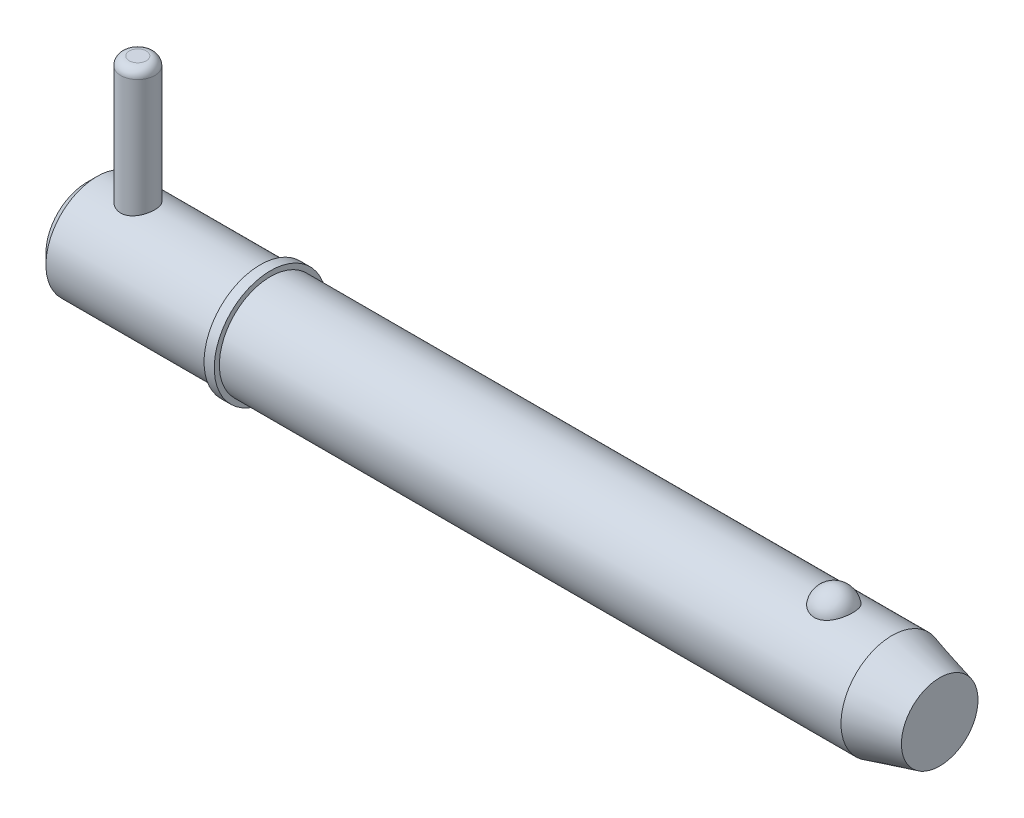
ISO-10303-21;
HEADER;
FILE_DESCRIPTION(('STEP AP214'),'2;1');
FILE_NAME('part.step','',(''),(''),'','','');
FILE_SCHEMA(('AUTOMOTIVE_DESIGN { 1 0 10303 214 1 1 1 1 }'));
ENDSEC;
DATA;
#1=APPLICATION_CONTEXT('core data for automotive mechanical design processes');
#2=APPLICATION_PROTOCOL_DEFINITION('international standard','automotive_design',2000,#1);
#3=PRODUCT_CONTEXT('',#1,'mechanical');
#4=PRODUCT('Part','Part','',(#3));
#5=PRODUCT_RELATED_PRODUCT_CATEGORY('part','',(#4));
#6=PRODUCT_DEFINITION_FORMATION('','',#4);
#7=PRODUCT_DEFINITION_CONTEXT('part definition',#1,'design');
#8=PRODUCT_DEFINITION('design','',#6,#7);
#9=PRODUCT_DEFINITION_SHAPE('','',#8);
#10=(LENGTH_UNIT() NAMED_UNIT(*) SI_UNIT(.MILLI.,.METRE.));
#11=(NAMED_UNIT(*) PLANE_ANGLE_UNIT() SI_UNIT($,.RADIAN.));
#12=(NAMED_UNIT(*) SI_UNIT($,.STERADIAN.) SOLID_ANGLE_UNIT());
#13=UNCERTAINTY_MEASURE_WITH_UNIT(LENGTH_MEASURE(1.E-05),#10,'distance_accuracy_value','');
#14=(GEOMETRIC_REPRESENTATION_CONTEXT(3) GLOBAL_UNCERTAINTY_ASSIGNED_CONTEXT((#13)) GLOBAL_UNIT_ASSIGNED_CONTEXT((#10,
#11,#12)) REPRESENTATION_CONTEXT('',''));
#15=CARTESIAN_POINT('',(0.,0.,0.));
#16=DIRECTION('',(0.,0.,1.));
#17=DIRECTION('',(1.,0.,0.));
#18=AXIS2_PLACEMENT_3D('',#15,#16,#17);
#19=CARTESIAN_POINT('',(7.14,24.605,0.));
#20=DIRECTION('',(0.,-1.,0.));
#21=DIRECTION('',(0.,0.,-1.));
#22=AXIS2_PLACEMENT_3D('',#19,#20,#21);
#23=CYLINDRICAL_SURFACE('',#22,2.38);
#24=CARTESIAN_POINT('',(7.14,-5.955,0.));
#25=DIRECTION('',(0.,1.,0.));
#26=DIRECTION('',(0.,0.,1.));
#27=AXIS2_PLACEMENT_3D('',#24,#25,#26);
#28=CIRCLE('',#27,2.38);
#29=CARTESIAN_POINT('',(7.14,-5.955,2.38));
#30=VERTEX_POINT('',#29);
#31=EDGE_CURVE('P0_E25',#30,#30,#28,.T.);
#32=ORIENTED_EDGE('',*,*,#31,.T.);
#33=EDGE_LOOP('',(#32));
#34=FACE_BOUND('',#33,.T.);
#35=CARTESIAN_POINT('',(7.14,23.415,0.));
#36=DIRECTION('',(0.,1.,0.));
#37=DIRECTION('',(0.,0.,1.));
#38=AXIS2_PLACEMENT_3D('',#35,#36,#37);
#39=CIRCLE('',#38,2.38);
#40=CARTESIAN_POINT('',(7.14,23.415,2.38));
#41=VERTEX_POINT('',#40);
#42=EDGE_CURVE('P0_E29',#41,#41,#39,.F.);
#43=ORIENTED_EDGE('',*,*,#42,.T.);
#44=EDGE_LOOP('',(#43));
#45=FACE_BOUND('',#44,.T.);
#46=ADVANCED_FACE('P0_F14',(#34,#45),#23,.T.);
#47=CARTESIAN_POINT('',(7.14,24.605,0.));
#48=DIRECTION('',(0.,1.,0.));
#49=DIRECTION('',(0.,0.,1.));
#50=AXIS2_PLACEMENT_3D('',#47,#48,#49);
#51=PLANE('',#50);
#52=CARTESIAN_POINT('',(7.14,24.605,0.));
#53=DIRECTION('',(0.,1.,0.));
#54=DIRECTION('',(0.,0.,1.));
#55=AXIS2_PLACEMENT_3D('',#52,#53,#54);
#56=CIRCLE('',#55,1.19);
#57=CARTESIAN_POINT('',(7.14,24.605,1.19));
#58=VERTEX_POINT('',#57);
#59=EDGE_CURVE('P0_E10',#58,#58,#56,.T.);
#60=ORIENTED_EDGE('',*,*,#59,.T.);
#61=EDGE_LOOP('',(#60));
#62=FACE_BOUND('',#61,.T.);
#63=ADVANCED_FACE('P0_F46',(#62),#51,.T.);
#64=CARTESIAN_POINT('',(7.14,-7.145,0.));
#65=DIRECTION('',(0.,1.,0.));
#66=DIRECTION('',(0.,0.,1.));
#67=AXIS2_PLACEMENT_3D('',#64,#65,#66);
#68=PLANE('',#67);
#69=CARTESIAN_POINT('',(7.14,-7.145,0.));
#70=DIRECTION('',(0.,1.,0.));
#71=DIRECTION('',(0.,0.,1.));
#72=AXIS2_PLACEMENT_3D('',#69,#70,#71);
#73=CIRCLE('',#72,1.19);
#74=CARTESIAN_POINT('',(7.14,-7.145,1.19));
#75=VERTEX_POINT('',#74);
#76=EDGE_CURVE('P0_E21',#75,#75,#73,.F.);
#77=ORIENTED_EDGE('',*,*,#76,.T.);
#78=EDGE_LOOP('',(#77));
#79=FACE_BOUND('',#78,.T.);
#80=ADVANCED_FACE('P0_F43',(#79),#68,.F.);
#81=CARTESIAN_POINT('',(7.14,-5.955,0.));
#82=DIRECTION('',(0.,1.,0.));
#83=DIRECTION('',(0.,0.,1.));
#84=AXIS2_PLACEMENT_3D('',#81,#82,#83);
#85=DEGENERATE_TOROIDAL_SURFACE('',#84,1.19,1.19,.T.);
#86=ORIENTED_EDGE('',*,*,#76,.F.);
#87=EDGE_LOOP('',(#86));
#88=FACE_BOUND('',#87,.T.);
#89=ORIENTED_EDGE('',*,*,#31,.F.);
#90=EDGE_LOOP('',(#89));
#91=FACE_BOUND('',#90,.T.);
#92=ADVANCED_FACE('P0_F38',(#88,#91),#85,.T.);
#93=CARTESIAN_POINT('',(7.14,23.415,0.));
#94=DIRECTION('',(0.,1.,0.));
#95=DIRECTION('',(0.,0.,1.));
#96=AXIS2_PLACEMENT_3D('',#93,#94,#95);
#97=DEGENERATE_TOROIDAL_SURFACE('',#96,1.19,1.19,.T.);
#98=ORIENTED_EDGE('',*,*,#42,.F.);
#99=EDGE_LOOP('',(#98));
#100=FACE_BOUND('',#99,.T.);
#101=ORIENTED_EDGE('',*,*,#59,.F.);
#102=EDGE_LOOP('',(#101));
#103=FACE_BOUND('',#102,.T.);
#104=ADVANCED_FACE('P0_F16',(#100,#103),#97,.T.);
#105=CLOSED_SHELL('',(#46,#63,#80,#92,#104));
#106=MANIFOLD_SOLID_BREP('P0_B1',#105);
#107=CARTESIAN_POINT('',(0.,0.,0.));
#108=DIRECTION('',(1.,0.,0.));
#109=DIRECTION('',(0.,0.,-1.));
#110=AXIS2_PLACEMENT_3D('',#107,#108,#109);
#111=CYLINDRICAL_SURFACE('',#110,7.145);
#112=CARTESIAN_POINT('',(112.68362424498,0.,0.));
#113=DIRECTION('',(1.,0.,0.));
#114=DIRECTION('',(0.,0.,-1.));
#115=AXIS2_PLACEMENT_3D('',#112,#113,#114);
#116=CIRCLE('',#115,7.145);
#117=CARTESIAN_POINT('',(112.68362424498,0.,-7.145));
#118=VERTEX_POINT('',#117);
#119=EDGE_CURVE('P1_E81',#118,#118,#116,.T.);
#120=ORIENTED_EDGE('',*,*,#119,.F.);
#121=EDGE_LOOP('',(#120));
#122=FACE_BOUND('',#121,.T.);
#123=CARTESIAN_POINT('',(25.7,0.,0.));
#124=DIRECTION('',(1.,0.,0.));
#125=DIRECTION('',(0.,0.,-1.));
#126=AXIS2_PLACEMENT_3D('',#123,#124,#125);
#127=CIRCLE('',#126,7.145);
#128=CARTESIAN_POINT('',(25.7,0.,-7.145));
#129=VERTEX_POINT('',#128);
#130=EDGE_CURVE('P1_E85',#129,#129,#127,.T.);
#131=ORIENTED_EDGE('',*,*,#130,.T.);
#132=EDGE_LOOP('',(#131));
#133=FACE_BOUND('',#132,.T.);
#134=CARTESIAN_POINT('',(104.539503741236,6.60328629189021,2.72903557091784));
#135=CARTESIAN_POINT('',(104.398315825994,6.60329644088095,2.7290249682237));
#136=CARTESIAN_POINT('',(104.256883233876,6.60799490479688,2.71772840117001));
#137=CARTESIAN_POINT('',(103.977955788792,6.62628236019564,2.67281935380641));
#138=CARTESIAN_POINT('',(103.840472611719,6.63989534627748,2.63914664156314));
#139=CARTESIAN_POINT('',(103.573889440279,6.67440775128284,2.55059642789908));
#140=CARTESIAN_POINT('',(103.444768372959,6.69528793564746,2.49577486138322));
#141=CARTESIAN_POINT('',(103.197869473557,6.74205585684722,2.36651799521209));
#142=CARTESIAN_POINT('',(103.080086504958,6.76794130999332,2.29209163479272));
#143=CARTESIAN_POINT('',(102.85516710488,6.82286177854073,2.12312937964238));
#144=CARTESIAN_POINT('',(102.748440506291,6.85196655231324,2.02807107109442));
#145=CARTESIAN_POINT('',(102.551918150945,6.90970232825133,1.82167822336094));
#146=CARTESIAN_POINT('',(102.462127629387,6.93833318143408,1.71033867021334));
#147=CARTESIAN_POINT('',(102.297667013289,6.9935167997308,1.46891951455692));
#148=CARTESIAN_POINT('',(102.223844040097,7.01992110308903,1.33822781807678));
#149=CARTESIAN_POINT('',(102.098088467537,7.06643385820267,1.06566567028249));
#150=CARTESIAN_POINT('',(102.04615735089,7.08654188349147,0.923794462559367));
#151=CARTESIAN_POINT('',(101.964732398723,7.11862399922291,0.630993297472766));
#152=CARTESIAN_POINT('',(101.935516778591,7.13049704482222,0.479974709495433));
#153=CARTESIAN_POINT('',(101.901174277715,7.14449484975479,0.174782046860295));
#154=CARTESIAN_POINT('',(101.896046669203,7.14661990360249,0.0206080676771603));
#155=CARTESIAN_POINT('',(101.909938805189,7.14092465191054,-0.285506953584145));
#156=CARTESIAN_POINT('',(101.928810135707,7.1331654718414,-0.43745589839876));
#157=CARTESIAN_POINT('',(101.990062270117,7.10859076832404,-0.735778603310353));
#158=CARTESIAN_POINT('',(102.032443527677,7.0917750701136,-0.882152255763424));
#159=CARTESIAN_POINT('',(102.139934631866,7.05076716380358,-1.165431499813));
#160=CARTESIAN_POINT('',(102.205075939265,7.02656475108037,-1.30232366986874));
#161=CARTESIAN_POINT('',(102.356759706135,6.97329145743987,-1.56265907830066));
#162=CARTESIAN_POINT('',(102.443303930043,6.94422017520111,-1.68610120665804));
#163=CARTESIAN_POINT('',(102.636465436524,6.88415108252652,-1.91671004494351));
#164=CARTESIAN_POINT('',(102.743180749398,6.85314438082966,-2.02379244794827));
#165=CARTESIAN_POINT('',(102.973974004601,6.79282069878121,-2.21787433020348));
#166=CARTESIAN_POINT('',(103.098050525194,6.76350358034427,-2.30487545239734));
#167=CARTESIAN_POINT('',(103.357678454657,6.71060580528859,-2.45458647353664));
#168=CARTESIAN_POINT('',(103.492938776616,6.68691885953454,-2.51776240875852));
#169=CARTESIAN_POINT('',(103.773277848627,6.64741247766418,-2.62030218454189));
#170=CARTESIAN_POINT('',(103.918352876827,6.63159007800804,-2.65967499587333));
#171=CARTESIAN_POINT('',(104.206347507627,6.61038594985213,-2.71193301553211));
#172=CARTESIAN_POINT('',(104.34900807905,6.60451880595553,-2.72605165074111));
#173=CARTESIAN_POINT('',(104.634800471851,6.60240611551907,-2.73116688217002));
#174=CARTESIAN_POINT('',(104.777932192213,6.60615862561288,-2.7221681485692));
#175=CARTESIAN_POINT('',(105.055848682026,6.6225609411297,-2.68200435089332));
#176=CARTESIAN_POINT('',(105.190754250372,6.63492533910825,-2.65154998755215));
#177=CARTESIAN_POINT('',(105.45332009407,6.66687445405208,-2.57015684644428));
#178=CARTESIAN_POINT('',(105.58097978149,6.68645975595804,-2.51921640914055));
#179=CARTESIAN_POINT('',(105.828577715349,6.73127274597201,-2.39693610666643));
#180=CARTESIAN_POINT('',(105.948287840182,6.7566138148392,-2.32517694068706));
#181=CARTESIAN_POINT('',(106.174159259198,6.81006003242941,-2.16363812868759));
#182=CARTESIAN_POINT('',(106.280317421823,6.83816581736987,-2.07385432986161));
#183=CARTESIAN_POINT('',(106.481862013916,6.89580469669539,-1.87357235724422));
#184=CARTESIAN_POINT('',(106.576440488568,6.92533863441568,-1.76226074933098));
#185=CARTESIAN_POINT('',(106.746332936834,6.98139526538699,-1.52511696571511));
#186=CARTESIAN_POINT('',(106.821643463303,7.0079174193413,-1.39928219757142));
#187=CARTESIAN_POINT('',(106.953595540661,7.05607625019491,-1.1321597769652));
#188=CARTESIAN_POINT('',(107.009568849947,7.07753119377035,-0.990508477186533));
#189=CARTESIAN_POINT('',(107.098296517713,7.11222355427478,-0.699154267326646));
#190=CARTESIAN_POINT('',(107.131050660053,7.12546089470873,-0.549451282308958));
#191=CARTESIAN_POINT('',(107.172689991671,7.1423758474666,-0.24612065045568));
#192=CARTESIAN_POINT('',(107.181558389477,7.14604673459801,-0.0924903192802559));
#193=CARTESIAN_POINT('',(107.175194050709,7.14343510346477,0.214181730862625));
#194=CARTESIAN_POINT('',(107.159961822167,7.13715279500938,0.367223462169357));
#195=CARTESIAN_POINT('',(107.105845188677,7.1153294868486,0.667595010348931));
#196=CARTESIAN_POINT('',(107.067077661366,7.09983424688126,0.814949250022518));
#197=CARTESIAN_POINT('',(106.966770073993,7.06119140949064,1.10063221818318));
#198=CARTESIAN_POINT('',(106.905228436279,7.03804328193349,1.238960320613));
#199=CARTESIAN_POINT('',(106.760207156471,6.98632429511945,1.50352300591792));
#200=CARTESIAN_POINT('',(106.676606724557,6.95772382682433,1.62968561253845));
#201=CARTESIAN_POINT('',(106.48938046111,6.89823072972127,1.86554304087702));
#202=CARTESIAN_POINT('',(106.385755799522,6.86733823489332,1.97523882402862));
#203=CARTESIAN_POINT('',(106.161076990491,6.80676456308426,2.17482293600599));
#204=CARTESIAN_POINT('',(106.040067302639,6.7770805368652,2.26476035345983));
#205=CARTESIAN_POINT('',(105.783340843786,6.7223050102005,2.42252989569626));
#206=CARTESIAN_POINT('',(105.64761851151,6.69721525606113,2.49035362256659));
#207=CARTESIAN_POINT('',(105.370402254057,6.65552591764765,2.59967646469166));
#208=CARTESIAN_POINT('',(105.229281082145,6.63865794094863,2.64202017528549));
#209=CARTESIAN_POINT('',(104.941444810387,6.61425039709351,2.7025584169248));
#210=CARTESIAN_POINT('',(104.794748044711,6.606682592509,2.72082606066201));
#211=CARTESIAN_POINT('',(104.611679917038,6.60358754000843,2.72830331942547));
#212=CARTESIAN_POINT('',(104.575599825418,6.60328369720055,2.72903828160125));
#213=CARTESIAN_POINT('',(104.539503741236,6.60328629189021,2.72903557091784));
#214=B_SPLINE_CURVE_WITH_KNOTS('',3,(#134,#135,#136,#137,#138,#139,#140,#141,#142,#143,#144,
#145,#146,#147,#148,#149,#150,#151,#152,#153,#154,#155,#156,#157,#158,#159,#160,#161,#162,#163,
#164,#165,#166,#167,#168,#169,#170,#171,#172,#173,#174,#175,#176,#177,#178,#179,#180,#181,#182,
#183,#184,#185,#186,#187,#188,#189,#190,#191,#192,#193,#194,#195,#196,#197,#198,#199,#200,#201,
#202,#203,#204,#205,#206,#207,#208,#209,#210,#211,#212,#213),.UNSPECIFIED.,.T.,.F.,(4,2,2,2,2,2,
2,2,2,2,2,2,2,2,2,2,2,2,2,2,2,2,2,2,2,2,2,2,2,2,2,2,2,2,2,2,2,2,2,4),(0.,0.423468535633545,
0.848081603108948,1.27157926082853,1.69488414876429,2.13051395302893,2.56627819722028,
3.02136706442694,3.47648674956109,3.93709649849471,4.39769233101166,4.85545355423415,
5.31322361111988,5.77162895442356,6.23007210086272,6.69080337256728,7.15149693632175,
7.60264329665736,8.05361952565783,8.4818972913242,8.91008854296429,9.32472524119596,
9.73939553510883,10.1630783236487,10.5868588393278,11.0319070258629,11.4770347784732,
11.9362874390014,12.3955443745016,12.8551240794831,13.3146940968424,13.7720003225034,
14.2293382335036,14.6892343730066,15.1491036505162,15.6078171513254,16.0667046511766,
16.5093965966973,16.9507410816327,17.0590049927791),.UNSPECIFIED.);
#215=CARTESIAN_POINT('',(104.539503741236,6.60328629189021,2.72903557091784));
#216=VERTEX_POINT('',#215);
#217=EDGE_CURVE('P1_E35',#216,#216,#214,.T.);
#218=ORIENTED_EDGE('',*,*,#217,.T.);
#219=EDGE_LOOP('',(#218));
#220=FACE_BOUND('',#219,.T.);
#221=ADVANCED_FACE('P1_F13',(#122,#133,#220),#111,.T.);
#222=CARTESIAN_POINT('',(0.,0.,0.));
#223=DIRECTION('',(-1.,0.,0.));
#224=DIRECTION('',(0.,0.,1.));
#225=AXIS2_PLACEMENT_3D('',#222,#223,#224);
#226=PLANE('',#225);
#227=CARTESIAN_POINT('',(0.,0.,0.));
#228=DIRECTION('',(1.,0.,0.));
#229=DIRECTION('',(0.,0.,-1.));
#230=AXIS2_PLACEMENT_3D('',#227,#228,#229);
#231=CIRCLE('',#230,5.716);
#232=CARTESIAN_POINT('',(0.,0.,-5.716));
#233=VERTEX_POINT('',#232);
#234=EDGE_CURVE('P1_E9',#233,#233,#231,.T.);
#235=ORIENTED_EDGE('',*,*,#234,.F.);
#236=EDGE_LOOP('',(#235));
#237=FACE_BOUND('',#236,.T.);
#238=ADVANCED_FACE('P1_F15',(#237),#226,.T.);
#239=CARTESIAN_POINT('',(1.42899999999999,0.,0.));
#240=DIRECTION('',(1.,0.,0.));
#241=DIRECTION('',(0.,0.,-1.));
#242=AXIS2_PLACEMENT_3D('',#239,#240,#241);
#243=CONICAL_SURFACE('',#242,7.145,0.78539816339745);
#244=ORIENTED_EDGE('',*,*,#234,.T.);
#245=EDGE_LOOP('',(#244));
#246=FACE_BOUND('',#245,.T.);
#247=CARTESIAN_POINT('',(1.42899999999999,0.,0.));
#248=DIRECTION('',(1.,0.,0.));
#249=DIRECTION('',(0.,0.,-1.));
#250=AXIS2_PLACEMENT_3D('',#247,#248,#249);
#251=CIRCLE('',#250,7.145);
#252=CARTESIAN_POINT('',(1.42899999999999,0.,-7.145));
#253=VERTEX_POINT('',#252);
#254=EDGE_CURVE('P1_E26',#253,#253,#251,.T.);
#255=ORIENTED_EDGE('',*,*,#254,.F.);
#256=EDGE_LOOP('',(#255));
#257=FACE_BOUND('',#256,.T.);
#258=ADVANCED_FACE('P1_F77',(#246,#257),#243,.T.);
#259=CARTESIAN_POINT('',(0.,0.,0.));
#260=DIRECTION('',(1.,0.,0.));
#261=DIRECTION('',(0.,0.,-1.));
#262=AXIS2_PLACEMENT_3D('',#259,#260,#261);
#263=CYLINDRICAL_SURFACE('',#262,7.145);
#264=CARTESIAN_POINT('',(7.14,-6.73695962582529,2.38));
#265=CARTESIAN_POINT('',(7.01035997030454,-6.73695921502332,2.38000059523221));
#266=CARTESIAN_POINT('',(6.88072348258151,-6.74074253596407,2.36937183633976));
#267=CARTESIAN_POINT('',(6.62529075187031,-6.75538853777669,2.32728080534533));
#268=CARTESIAN_POINT('',(6.49949514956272,-6.76625239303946,2.29581507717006));
#269=CARTESIAN_POINT('',(6.2554858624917,-6.79369535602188,2.21327763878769));
#270=CARTESIAN_POINT('',(6.13725786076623,-6.81026326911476,2.16224430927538));
#271=CARTESIAN_POINT('',(5.91100349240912,-6.84723128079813,2.04215132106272));
#272=CARTESIAN_POINT('',(5.80297937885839,-6.86763222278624,1.97308769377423));
#273=CARTESIAN_POINT('',(5.59597854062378,-6.91086152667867,1.81600414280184));
#274=CARTESIAN_POINT('',(5.49745861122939,-6.93375032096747,1.72739874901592));
#275=CARTESIAN_POINT('',(5.31636508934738,-6.97886546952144,1.53499636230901));
#276=CARTESIAN_POINT('',(5.23379405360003,-7.00109171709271,1.43119693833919));
#277=CARTESIAN_POINT('',(5.08487013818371,-7.04307708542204,1.20801318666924));
#278=CARTESIAN_POINT('',(5.01899578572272,-7.06275685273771,1.08829330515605));
#279=CARTESIAN_POINT('',(4.90850130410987,-7.09671988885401,0.838703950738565));
#280=CARTESIAN_POINT('',(4.86387545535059,-7.11100460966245,0.70883722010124));
#281=CARTESIAN_POINT('',(4.79869354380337,-7.13213998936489,0.44742990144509));
#282=CARTESIAN_POINT('',(4.77735497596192,-7.13923172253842,0.316104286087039));
#283=CARTESIAN_POINT('',(4.75686536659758,-7.14603777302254,0.0515578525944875));
#284=CARTESIAN_POINT('',(4.75770861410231,-7.14575398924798,-0.0816624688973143));
#285=CARTESIAN_POINT('',(4.78106216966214,-7.13800438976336,-0.340678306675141));
#286=CARTESIAN_POINT('',(4.80272255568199,-7.13082030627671,-0.466560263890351));
#287=CARTESIAN_POINT('',(4.86569013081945,-7.11043095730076,-0.712788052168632));
#288=CARTESIAN_POINT('',(4.90699865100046,-7.09722528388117,-0.833133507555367));
#289=CARTESIAN_POINT('',(5.00858673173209,-7.06591754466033,-1.06673173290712));
#290=CARTESIAN_POINT('',(5.06910834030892,-7.0477534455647,-1.17987058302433));
#291=CARTESIAN_POINT('',(5.20720514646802,-7.00841977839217,-1.39463797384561));
#292=CARTESIAN_POINT('',(5.28478508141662,-6.987249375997,-1.49626330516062));
#293=CARTESIAN_POINT('',(5.4590800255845,-6.94296010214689,-1.69017445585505));
#294=CARTESIAN_POINT('',(5.55652324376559,-6.91979641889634,-1.78179645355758));
#295=CARTESIAN_POINT('',(5.76558873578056,-6.87497076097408,-1.94761348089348));
#296=CARTESIAN_POINT('',(5.87721318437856,-6.85330901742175,-2.02180583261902));
#297=CARTESIAN_POINT('',(6.11357367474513,-6.81369485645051,-2.15157488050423));
#298=CARTESIAN_POINT('',(6.23847358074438,-6.79579956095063,-2.20687188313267));
#299=CARTESIAN_POINT('',(6.49655785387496,-6.76640630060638,-2.29542443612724));
#300=CARTESIAN_POINT('',(6.62973872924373,-6.75490565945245,-2.32868920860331));
#301=CARTESIAN_POINT('',(6.89417536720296,-6.74020933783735,-2.37088225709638));
#302=CARTESIAN_POINT('',(7.02524746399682,-6.73666278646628,-2.38083959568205));
#303=CARTESIAN_POINT('',(7.28721035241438,-6.73729555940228,-2.37904974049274));
#304=CARTESIAN_POINT('',(7.41810117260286,-6.7414734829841,-2.36730648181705));
#305=CARTESIAN_POINT('',(7.67130717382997,-6.75673471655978,-2.32337336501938));
#306=CARTESIAN_POINT('',(7.79376251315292,-6.76757635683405,-2.29189834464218));
#307=CARTESIAN_POINT('',(8.03162917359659,-6.79467771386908,-2.21025275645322));
#308=CARTESIAN_POINT('',(8.14703924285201,-6.8109383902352,-2.16007887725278));
#309=CARTESIAN_POINT('',(8.37159169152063,-6.84768362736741,-2.04065289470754));
#310=CARTESIAN_POINT('',(8.48041962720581,-6.86828569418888,-1.97084668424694));
#311=CARTESIAN_POINT('',(8.68518919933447,-6.91116416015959,-1.8147657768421));
#312=CARTESIAN_POINT('',(8.78112702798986,-6.93344105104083,-1.72848623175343));
#313=CARTESIAN_POINT('',(8.96215574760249,-6.97845348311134,-1.53698616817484));
#314=CARTESIAN_POINT('',(9.04650427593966,-7.00115965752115,-1.43105491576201));
#315=CARTESIAN_POINT('',(9.19627592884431,-7.04341676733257,-1.20598377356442));
#316=CARTESIAN_POINT('',(9.26169972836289,-7.06296781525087,-1.08684435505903));
#317=CARTESIAN_POINT('',(9.37116617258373,-7.0966205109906,-0.83933303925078));
#318=CARTESIAN_POINT('',(9.41534821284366,-7.11075755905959,-0.711027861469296));
#319=CARTESIAN_POINT('',(9.48132660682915,-7.13214194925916,-0.448245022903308));
#320=CARTESIAN_POINT('',(9.50313102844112,-7.13939177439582,-0.313769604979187));
#321=CARTESIAN_POINT('',(9.5230098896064,-7.14599771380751,-0.049254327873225));
#322=CARTESIAN_POINT('',(9.52215013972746,-7.14570837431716,0.0806974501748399));
#323=CARTESIAN_POINT('',(9.49935359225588,-7.13814116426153,0.338518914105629));
#324=CARTESIAN_POINT('',(9.47741850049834,-7.13086385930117,0.466388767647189));
#325=CARTESIAN_POINT('',(9.4138005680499,-7.11026814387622,0.714400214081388));
#326=CARTESIAN_POINT('',(9.37243609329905,-7.09704726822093,0.834632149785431));
#327=CARTESIAN_POINT('',(9.27142829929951,-7.06592602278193,1.06649582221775));
#328=CARTESIAN_POINT('',(9.2117816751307,-7.04802480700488,1.1781259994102));
#329=CARTESIAN_POINT('',(9.07336776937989,-7.00856499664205,1.39411030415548));
#330=CARTESIAN_POINT('',(8.99397590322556,-6.98689577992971,1.49804368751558));
#331=CARTESIAN_POINT('',(8.81938810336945,-6.9426110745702,1.69146078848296));
#332=CARTESIAN_POINT('',(8.72418713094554,-6.91999528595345,1.78093988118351));
#333=CARTESIAN_POINT('',(8.51623540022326,-6.87531507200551,1.94646188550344));
#334=CARTESIAN_POINT('',(8.4029442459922,-6.85330672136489,2.02184316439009));
#335=CARTESIAN_POINT('',(8.16461714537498,-6.81342065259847,2.1524427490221));
#336=CARTESIAN_POINT('',(8.03958429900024,-6.7955418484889,2.20766635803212));
#337=CARTESIAN_POINT('',(7.78712566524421,-6.76686117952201,2.29403636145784));
#338=CARTESIAN_POINT('',(7.66006989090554,-6.75577342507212,2.32616709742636));
#339=CARTESIAN_POINT('',(7.40200728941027,-6.74082409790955,2.36914495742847));
#340=CARTESIAN_POINT('',(7.27100183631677,-6.73696004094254,2.37999939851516));
#341=CARTESIAN_POINT('',(7.14,-6.73695962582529,2.38));
#342=B_SPLINE_CURVE_WITH_KNOTS('',3,(#264,#265,#266,#267,#268,#269,#270,#271,#272,#273,#274,
#275,#276,#277,#278,#279,#280,#281,#282,#283,#284,#285,#286,#287,#288,#289,#290,#291,#292,#293,
#294,#295,#296,#297,#298,#299,#300,#301,#302,#303,#304,#305,#306,#307,#308,#309,#310,#311,#312,
#313,#314,#315,#316,#317,#318,#319,#320,#321,#322,#323,#324,#325,#326,#327,#328,#329,#330,#331,
#332,#333,#334,#335,#336,#337,#338,#339,#340,#341),.UNSPECIFIED.,.T.,.F.,(4,2,2,2,2,2,2,2,2,2,2,
2,2,2,2,2,2,2,2,2,2,2,2,2,2,2,2,2,2,2,2,2,2,2,2,2,2,2,4),(0.,0.388434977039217,
0.776934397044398,1.16467566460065,1.55250234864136,1.9540847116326,2.35573139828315,
2.76784120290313,3.17984001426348,3.57752248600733,3.97510257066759,4.35711073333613,
4.7391447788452,5.12619663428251,5.51335611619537,5.91871976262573,6.3241456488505,
6.73533623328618,7.14635459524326,7.53885245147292,7.93127914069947,8.31025106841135,
8.68929014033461,9.08033871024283,9.47150254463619,9.88145528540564,10.2913934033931,
10.6986033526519,11.1056664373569,11.4936225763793,11.8815473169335,12.2633262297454,
12.645174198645,13.0411187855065,13.437189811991,13.8487371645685,14.2601761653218,
14.6528265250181,15.0453418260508),.UNSPECIFIED.);
#343=CARTESIAN_POINT('',(7.14,-6.73695962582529,2.38));
#344=VERTEX_POINT('',#343);
#345=EDGE_CURVE('P1_E17',#344,#344,#342,.T.);
#346=ORIENTED_EDGE('',*,*,#345,.F.);
#347=EDGE_LOOP('',(#346));
#348=FACE_BOUND('',#347,.T.);
#349=CARTESIAN_POINT('',(7.14,6.73695962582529,2.38));
#350=CARTESIAN_POINT('',(7.26964002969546,6.73695921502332,2.38000059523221));
#351=CARTESIAN_POINT('',(7.39927651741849,6.74074253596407,2.36937183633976));
#352=CARTESIAN_POINT('',(7.65470924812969,6.75538853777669,2.32728080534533));
#353=CARTESIAN_POINT('',(7.78050485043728,6.76625239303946,2.29581507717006));
#354=CARTESIAN_POINT('',(8.02451413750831,6.79369535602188,2.21327763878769));
#355=CARTESIAN_POINT('',(8.14274213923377,6.81026326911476,2.16224430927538));
#356=CARTESIAN_POINT('',(8.36899650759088,6.84723128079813,2.04215132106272));
#357=CARTESIAN_POINT('',(8.47702062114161,6.86763222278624,1.97308769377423));
#358=CARTESIAN_POINT('',(8.68402145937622,6.91086152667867,1.81600414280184));
#359=CARTESIAN_POINT('',(8.78254138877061,6.93375032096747,1.72739874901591));
#360=CARTESIAN_POINT('',(8.96363491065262,6.97886546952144,1.53499636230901));
#361=CARTESIAN_POINT('',(9.04620594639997,7.00109171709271,1.43119693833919));
#362=CARTESIAN_POINT('',(9.19512986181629,7.04307708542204,1.20801318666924));
#363=CARTESIAN_POINT('',(9.26100421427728,7.06275685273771,1.08829330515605));
#364=CARTESIAN_POINT('',(9.37149869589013,7.09671988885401,0.838703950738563));
#365=CARTESIAN_POINT('',(9.41612454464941,7.11100460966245,0.708837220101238));
#366=CARTESIAN_POINT('',(9.48130645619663,7.13213998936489,0.447429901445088));
#367=CARTESIAN_POINT('',(9.50264502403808,7.13923172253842,0.316104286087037));
#368=CARTESIAN_POINT('',(9.52313463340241,7.14603777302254,0.0515578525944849));
#369=CARTESIAN_POINT('',(9.52229138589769,7.14575398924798,-0.0816624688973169));
#370=CARTESIAN_POINT('',(9.49893783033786,7.13800438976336,-0.340678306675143));
#371=CARTESIAN_POINT('',(9.47727744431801,7.13082030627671,-0.466560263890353));
#372=CARTESIAN_POINT('',(9.41430986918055,7.11043095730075,-0.712788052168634));
#373=CARTESIAN_POINT('',(9.37300134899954,7.09722528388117,-0.833133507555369));
#374=CARTESIAN_POINT('',(9.27141326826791,7.06591754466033,-1.06673173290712));
#375=CARTESIAN_POINT('',(9.21089165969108,7.0477534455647,-1.17987058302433));
#376=CARTESIAN_POINT('',(9.07279485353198,7.00841977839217,-1.39463797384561));
#377=CARTESIAN_POINT('',(8.99521491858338,6.987249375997,-1.49626330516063));
#378=CARTESIAN_POINT('',(8.82091997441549,6.94296010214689,-1.69017445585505));
#379=CARTESIAN_POINT('',(8.72347675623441,6.91979641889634,-1.78179645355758));
#380=CARTESIAN_POINT('',(8.51441126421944,6.87497076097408,-1.94761348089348));
#381=CARTESIAN_POINT('',(8.40278681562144,6.85330901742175,-2.02180583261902));
#382=CARTESIAN_POINT('',(8.16642632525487,6.81369485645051,-2.15157488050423));
#383=CARTESIAN_POINT('',(8.04152641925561,6.79579956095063,-2.20687188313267));
#384=CARTESIAN_POINT('',(7.78344214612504,6.76640630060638,-2.29542443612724));
#385=CARTESIAN_POINT('',(7.65026127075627,6.75490565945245,-2.32868920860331));
#386=CARTESIAN_POINT('',(7.38582463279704,6.74020933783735,-2.37088225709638));
#387=CARTESIAN_POINT('',(7.25475253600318,6.73666278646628,-2.38083959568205));
#388=CARTESIAN_POINT('',(6.99278964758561,6.73729555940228,-2.37904974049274));
#389=CARTESIAN_POINT('',(6.86189882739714,6.7414734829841,-2.36730648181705));
#390=CARTESIAN_POINT('',(6.60869282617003,6.75673471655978,-2.32337336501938));
#391=CARTESIAN_POINT('',(6.48623748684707,6.76757635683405,-2.29189834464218));
#392=CARTESIAN_POINT('',(6.2483708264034,6.79467771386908,-2.21025275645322));
#393=CARTESIAN_POINT('',(6.13296075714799,6.8109383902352,-2.16007887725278));
#394=CARTESIAN_POINT('',(5.90840830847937,6.84768362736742,-2.04065289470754));
#395=CARTESIAN_POINT('',(5.79958037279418,6.86828569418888,-1.97084668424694));
#396=CARTESIAN_POINT('',(5.59481080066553,6.91116416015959,-1.8147657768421));
#397=CARTESIAN_POINT('',(5.49887297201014,6.93344105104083,-1.72848623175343));
#398=CARTESIAN_POINT('',(5.31784425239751,6.97845348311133,-1.53698616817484));
#399=CARTESIAN_POINT('',(5.23349572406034,7.00115965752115,-1.43105491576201));
#400=CARTESIAN_POINT('',(5.08372407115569,7.04341676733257,-1.20598377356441));
#401=CARTESIAN_POINT('',(5.01830027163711,7.06296781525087,-1.08684435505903));
#402=CARTESIAN_POINT('',(4.90883382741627,7.0966205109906,-0.839333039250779));
#403=CARTESIAN_POINT('',(4.86465178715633,7.11075755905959,-0.711027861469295));
#404=CARTESIAN_POINT('',(4.79867339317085,7.13214194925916,-0.448245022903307));
#405=CARTESIAN_POINT('',(4.77686897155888,7.13939177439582,-0.313769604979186));
#406=CARTESIAN_POINT('',(4.7569901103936,7.14599771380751,-0.0492543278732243));
#407=CARTESIAN_POINT('',(4.75784986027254,7.14570837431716,0.0806974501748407));
#408=CARTESIAN_POINT('',(4.78064640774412,7.13814116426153,0.33851891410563));
#409=CARTESIAN_POINT('',(4.80258149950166,7.13086385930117,0.46638876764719));
#410=CARTESIAN_POINT('',(4.8661994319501,7.11026814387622,0.714400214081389));
#411=CARTESIAN_POINT('',(4.90756390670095,7.09704726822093,0.834632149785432));
#412=CARTESIAN_POINT('',(5.00857170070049,7.06592602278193,1.06649582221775));
#413=CARTESIAN_POINT('',(5.0682183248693,7.04802480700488,1.1781259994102));
#414=CARTESIAN_POINT('',(5.20663223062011,7.00856499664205,1.39411030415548));
#415=CARTESIAN_POINT('',(5.28602409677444,6.98689577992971,1.49804368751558));
#416=CARTESIAN_POINT('',(5.46061189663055,6.9426110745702,1.69146078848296));
#417=CARTESIAN_POINT('',(5.55581286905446,6.91999528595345,1.78093988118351));
#418=CARTESIAN_POINT('',(5.76376459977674,6.87531507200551,1.94646188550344));
#419=CARTESIAN_POINT('',(5.8770557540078,6.85330672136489,2.02184316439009));
#420=CARTESIAN_POINT('',(6.11538285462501,6.81342065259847,2.1524427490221));
#421=CARTESIAN_POINT('',(6.24041570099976,6.7955418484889,2.20766635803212));
#422=CARTESIAN_POINT('',(6.4928743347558,6.76686117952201,2.29403636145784));
#423=CARTESIAN_POINT('',(6.61993010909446,6.75577342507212,2.32616709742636));
#424=CARTESIAN_POINT('',(6.87799271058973,6.74082409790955,2.36914495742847));
#425=CARTESIAN_POINT('',(7.00899816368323,6.73696004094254,2.37999939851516));
#426=CARTESIAN_POINT('',(7.14,6.73695962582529,2.38));
#427=B_SPLINE_CURVE_WITH_KNOTS('',3,(#349,#350,#351,#352,#353,#354,#355,#356,#357,#358,#359,
#360,#361,#362,#363,#364,#365,#366,#367,#368,#369,#370,#371,#372,#373,#374,#375,#376,#377,#378,
#379,#380,#381,#382,#383,#384,#385,#386,#387,#388,#389,#390,#391,#392,#393,#394,#395,#396,#397,
#398,#399,#400,#401,#402,#403,#404,#405,#406,#407,#408,#409,#410,#411,#412,#413,#414,#415,#416,
#417,#418,#419,#420,#421,#422,#423,#424,#425,#426),.UNSPECIFIED.,.T.,.F.,(4,2,2,2,2,2,2,2,2,2,2,
2,2,2,2,2,2,2,2,2,2,2,2,2,2,2,2,2,2,2,2,2,2,2,2,2,2,2,4),(0.,0.388434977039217,
0.776934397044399,1.16467566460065,1.55250234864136,1.9540847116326,2.35573139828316,
2.76784120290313,3.17984001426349,3.57752248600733,3.97510257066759,4.35711073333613,
4.73914477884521,5.12619663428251,5.51335611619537,5.91871976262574,6.3241456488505,
6.73533623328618,7.14635459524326,7.53885245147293,7.93127914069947,8.31025106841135,
8.68929014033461,9.08033871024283,9.47150254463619,9.88145528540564,10.2913934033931,
10.6986033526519,11.1056664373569,11.4936225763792,11.8815473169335,12.2633262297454,
12.645174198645,13.0411187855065,13.437189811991,13.8487371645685,14.2601761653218,
14.6528265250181,15.0453418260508),.UNSPECIFIED.);
#428=CARTESIAN_POINT('',(7.14,6.73695962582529,2.38));
#429=VERTEX_POINT('',#428);
#430=EDGE_CURVE('P1_E43',#429,#429,#427,.T.);
#431=ORIENTED_EDGE('',*,*,#430,.F.);
#432=EDGE_LOOP('',(#431));
#433=FACE_BOUND('',#432,.T.);
#434=ORIENTED_EDGE('',*,*,#254,.T.);
#435=EDGE_LOOP('',(#434));
#436=FACE_BOUND('',#435,.T.);
#437=CARTESIAN_POINT('',(24.271,0.,0.));
#438=DIRECTION('',(1.,0.,0.));
#439=DIRECTION('',(0.,0.,-1.));
#440=AXIS2_PLACEMENT_3D('',#437,#438,#439);
#441=CIRCLE('',#440,7.145);
#442=CARTESIAN_POINT('',(24.271,0.,-7.145));
#443=VERTEX_POINT('',#442);
#444=EDGE_CURVE('P1_E31',#443,#443,#441,.T.);
#445=ORIENTED_EDGE('',*,*,#444,.F.);
#446=EDGE_LOOP('',(#445));
#447=FACE_BOUND('',#446,.T.);
#448=ADVANCED_FACE('P1_F103',(#348,#433,#436,#447),#263,.T.);
#449=CARTESIAN_POINT('',(24.271,7.145,0.));
#450=DIRECTION('',(-1.,0.,0.));
#451=DIRECTION('',(0.,0.,1.));
#452=AXIS2_PLACEMENT_3D('',#449,#450,#451);
#453=PLANE('',#452);
#454=ORIENTED_EDGE('',*,*,#444,.T.);
#455=EDGE_LOOP('',(#454));
#456=FACE_BOUND('',#455,.T.);
#457=CARTESIAN_POINT('',(24.271,0.,0.));
#458=DIRECTION('',(1.,0.,0.));
#459=DIRECTION('',(0.,0.,-1.));
#460=AXIS2_PLACEMENT_3D('',#457,#458,#459);
#461=CIRCLE('',#460,7.8595);
#462=CARTESIAN_POINT('',(24.271,0.,-7.8595));
#463=VERTEX_POINT('',#462);
#464=EDGE_CURVE('P1_E91',#463,#463,#461,.T.);
#465=ORIENTED_EDGE('',*,*,#464,.F.);
#466=EDGE_LOOP('',(#465));
#467=FACE_BOUND('',#466,.T.);
#468=ADVANCED_FACE('P1_F100',(#456,#467),#453,.T.);
#469=CARTESIAN_POINT('',(0.,0.,0.));
#470=DIRECTION('',(1.,0.,0.));
#471=DIRECTION('',(0.,0.,-1.));
#472=AXIS2_PLACEMENT_3D('',#469,#470,#471);
#473=CYLINDRICAL_SURFACE('',#472,7.8595);
#474=ORIENTED_EDGE('',*,*,#464,.T.);
#475=EDGE_LOOP('',(#474));
#476=FACE_BOUND('',#475,.T.);
#477=CARTESIAN_POINT('',(25.7,0.,0.));
#478=DIRECTION('',(1.,0.,0.));
#479=DIRECTION('',(0.,0.,-1.));
#480=AXIS2_PLACEMENT_3D('',#477,#478,#479);
#481=CIRCLE('',#480,7.8595);
#482=CARTESIAN_POINT('',(25.7,0.,-7.8595));
#483=VERTEX_POINT('',#482);
#484=EDGE_CURVE('P1_E88',#483,#483,#481,.T.);
#485=ORIENTED_EDGE('',*,*,#484,.F.);
#486=EDGE_LOOP('',(#485));
#487=FACE_BOUND('',#486,.T.);
#488=ADVANCED_FACE('P1_F68',(#476,#487),#473,.T.);
#489=CARTESIAN_POINT('',(25.7,7.8595,0.));
#490=DIRECTION('',(1.,0.,0.));
#491=DIRECTION('',(0.,0.,-1.));
#492=AXIS2_PLACEMENT_3D('',#489,#490,#491);
#493=PLANE('',#492);
#494=ORIENTED_EDGE('',*,*,#484,.T.);
#495=EDGE_LOOP('',(#494));
#496=FACE_BOUND('',#495,.T.);
#497=ORIENTED_EDGE('',*,*,#130,.F.);
#498=EDGE_LOOP('',(#497));
#499=FACE_BOUND('',#498,.T.);
#500=ADVANCED_FACE('P1_F62',(#496,#499),#493,.T.);
#501=CARTESIAN_POINT('',(119.35,0.,0.));
#502=DIRECTION('',(-1.,0.,0.));
#503=DIRECTION('',(0.,0.,1.));
#504=AXIS2_PLACEMENT_3D('',#501,#502,#503);
#505=CONICAL_SURFACE('',#504,5.35875000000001,0.26179938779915);
#506=ORIENTED_EDGE('',*,*,#119,.T.);
#507=EDGE_LOOP('',(#506));
#508=FACE_BOUND('',#507,.T.);
#509=CARTESIAN_POINT('',(119.35,0.,0.));
#510=DIRECTION('',(1.,0.,0.));
#511=DIRECTION('',(0.,0.,-1.));
#512=AXIS2_PLACEMENT_3D('',#509,#510,#511);
#513=CIRCLE('',#512,5.35875000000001);
#514=CARTESIAN_POINT('',(119.35,0.,-5.35875000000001));
#515=VERTEX_POINT('',#514);
#516=EDGE_CURVE('P1_E42',#515,#515,#513,.T.);
#517=ORIENTED_EDGE('',*,*,#516,.F.);
#518=EDGE_LOOP('',(#517));
#519=FACE_BOUND('',#518,.T.);
#520=ADVANCED_FACE('P1_F59',(#508,#519),#505,.T.);
#521=CARTESIAN_POINT('',(119.35,5.35875000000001,0.));
#522=DIRECTION('',(1.,0.,0.));
#523=DIRECTION('',(0.,0.,-1.));
#524=AXIS2_PLACEMENT_3D('',#521,#522,#523);
#525=PLANE('',#524);
#526=ORIENTED_EDGE('',*,*,#516,.T.);
#527=EDGE_LOOP('',(#526));
#528=FACE_BOUND('',#527,.T.);
#529=ADVANCED_FACE('P1_F55',(#528),#525,.T.);
#530=CARTESIAN_POINT('',(104.539503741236,6.4305,0.));
#531=DIRECTION('',(-1.,0.,0.));
#532=DIRECTION('',(0.,-1.,0.));
#533=AXIS2_PLACEMENT_3D('',#530,#531,#532);
#534=SPHERICAL_SURFACE('',#533,2.7345);
#535=ORIENTED_EDGE('',*,*,#217,.F.);
#536=EDGE_LOOP('',(#535));
#537=FACE_BOUND('',#536,.T.);
#538=ADVANCED_FACE('P1_F50',(#537),#534,.T.);
#539=CARTESIAN_POINT('',(7.14,-7.8595,0.));
#540=DIRECTION('',(0.,1.,0.));
#541=DIRECTION('',(0.,0.,1.));
#542=AXIS2_PLACEMENT_3D('',#539,#540,#541);
#543=CYLINDRICAL_SURFACE('',#542,2.38);
#544=ORIENTED_EDGE('',*,*,#345,.T.);
#545=EDGE_LOOP('',(#544));
#546=FACE_BOUND('',#545,.T.);
#547=ORIENTED_EDGE('',*,*,#430,.T.);
#548=EDGE_LOOP('',(#547));
#549=FACE_BOUND('',#548,.T.);
#550=ADVANCED_FACE('P1_F54',(#546,#549),#543,.F.);
#551=CLOSED_SHELL('',(#221,#238,#258,#448,#468,#488,#500,#520,#529,#538,#550));
#552=MANIFOLD_SOLID_BREP('P1_B1',#551);
#553=ADVANCED_BREP_SHAPE_REPRESENTATION('',(#18,#106,#552),#14);
#554=SHAPE_DEFINITION_REPRESENTATION(#9,#553);
ENDSEC;
END-ISO-10303-21;
